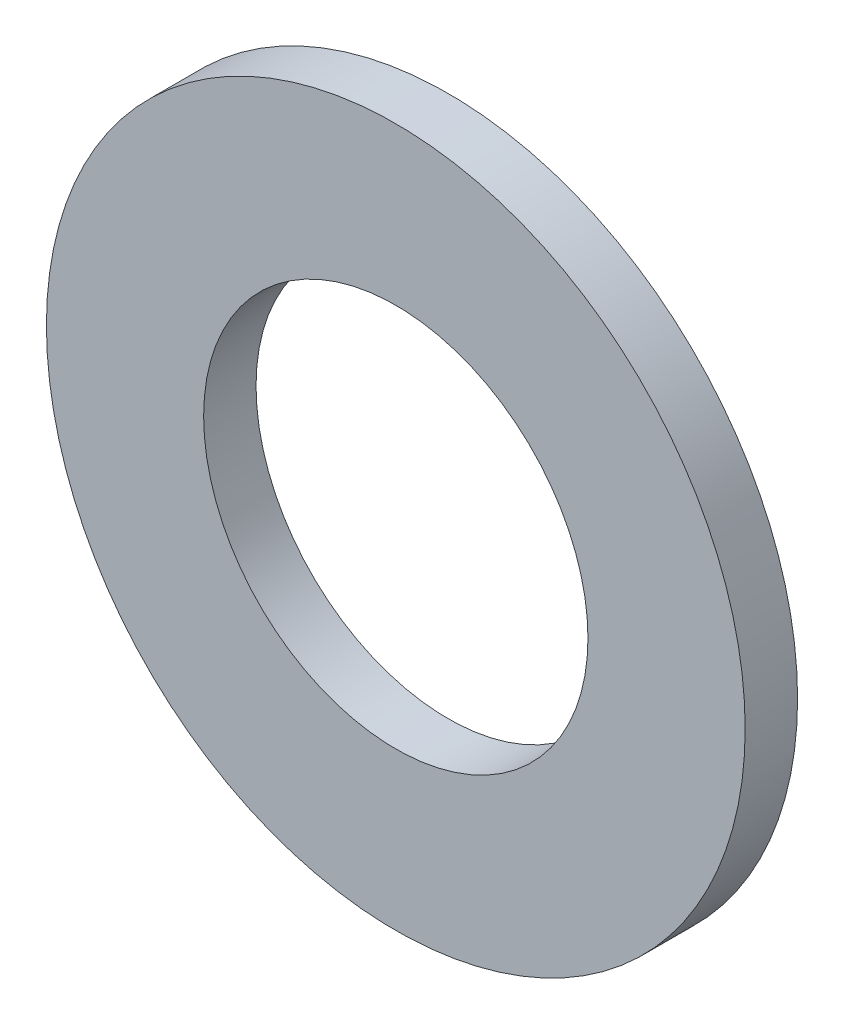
from build123d import *

# Parameters (mm, degrees)
ESQUISSE1_R          = 20
ESQUISSE1_R_2        = 11
BASE_EXTRUSION_DEPTH = 1.5


with BuildPart() as part:
    # Esquisse1 → Base-Extrusion (new, symmetric)
    with BuildSketch(Plane.XY):
        Circle(ESQUISSE1_R)
        Circle(ESQUISSE1_R_2, mode=Mode.SUBTRACT)
    extrude(amount=BASE_EXTRUSION_DEPTH, both=True)


solid = part.part
